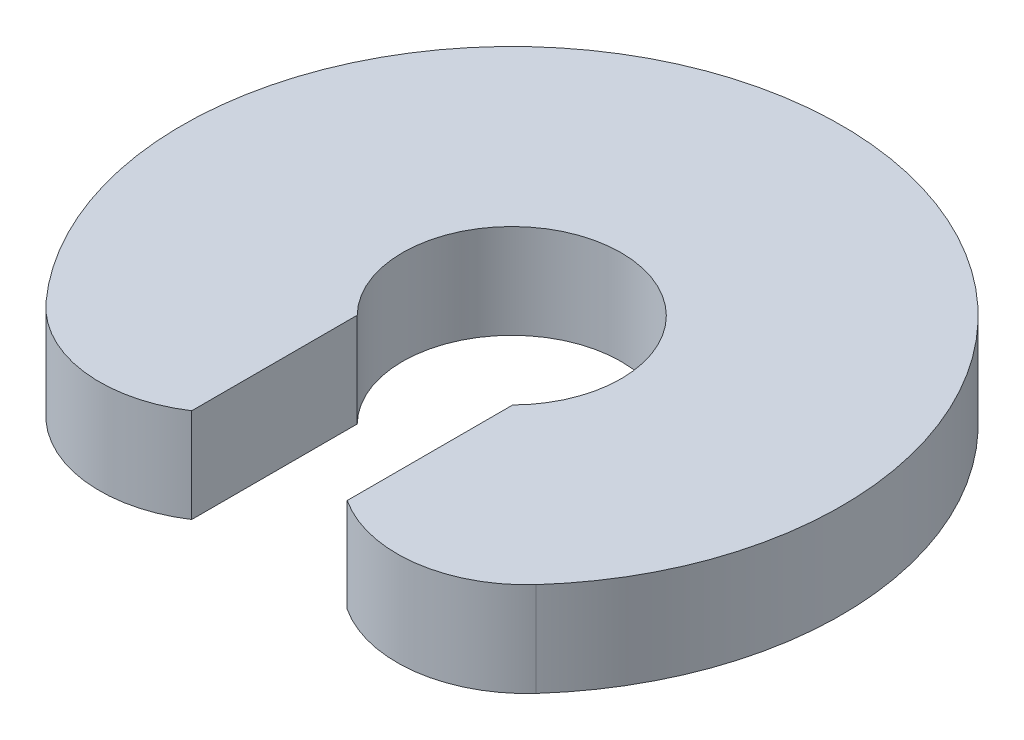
ISO-10303-21;
HEADER;
FILE_DESCRIPTION(('STEP AP214'),'2;1');
FILE_NAME('part.step','',(''),(''),'','','');
FILE_SCHEMA(('AUTOMOTIVE_DESIGN { 1 0 10303 214 1 1 1 1 }'));
ENDSEC;
DATA;
#1=APPLICATION_CONTEXT('core data for automotive mechanical design processes');
#2=APPLICATION_PROTOCOL_DEFINITION('international standard','automotive_design',2000,#1);
#3=PRODUCT_CONTEXT('',#1,'mechanical');
#4=PRODUCT('Part','Part','',(#3));
#5=PRODUCT_RELATED_PRODUCT_CATEGORY('part','',(#4));
#6=PRODUCT_DEFINITION_FORMATION('','',#4);
#7=PRODUCT_DEFINITION_CONTEXT('part definition',#1,'design');
#8=PRODUCT_DEFINITION('design','',#6,#7);
#9=PRODUCT_DEFINITION_SHAPE('','',#8);
#10=(LENGTH_UNIT() NAMED_UNIT(*) SI_UNIT(.MILLI.,.METRE.));
#11=(NAMED_UNIT(*) PLANE_ANGLE_UNIT() SI_UNIT($,.RADIAN.));
#12=(NAMED_UNIT(*) SI_UNIT($,.STERADIAN.) SOLID_ANGLE_UNIT());
#13=UNCERTAINTY_MEASURE_WITH_UNIT(LENGTH_MEASURE(1.E-05),#10,'distance_accuracy_value','');
#14=(GEOMETRIC_REPRESENTATION_CONTEXT(3) GLOBAL_UNCERTAINTY_ASSIGNED_CONTEXT((#13)) GLOBAL_UNIT_ASSIGNED_CONTEXT((#10,
#11,#12)) REPRESENTATION_CONTEXT('',''));
#15=CARTESIAN_POINT('',(0.,0.,0.));
#16=DIRECTION('',(0.,0.,1.));
#17=DIRECTION('',(1.,0.,0.));
#18=AXIS2_PLACEMENT_3D('',#15,#16,#17);
#19=CARTESIAN_POINT('',(315.836550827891,200.,284.380507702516));
#20=DIRECTION('',(0.,-1.,0.));
#21=DIRECTION('',(0.,0.,-1.));
#22=AXIS2_PLACEMENT_3D('',#19,#20,#21);
#23=CYLINDRICAL_SURFACE('',#22,275.);
#24=DIRECTION('',(0.,-1.,0.));
#25=VECTOR('',#24,1.);
#26=CARTESIAN_POINT('',(165.,200.,514.322532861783));
#27=LINE('',#26,#25);
#28=CARTESIAN_POINT('',(165.,200.,514.322532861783));
#29=VERTEX_POINT('',#28);
#30=CARTESIAN_POINT('',(165.,0.,514.322532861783));
#31=VERTEX_POINT('',#30);
#32=EDGE_CURVE('E105',#29,#31,#27,.T.);
#33=ORIENTED_EDGE('',*,*,#32,.T.);
#34=CARTESIAN_POINT('',(315.836550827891,0.,284.380507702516));
#35=DIRECTION('',(0.,1.,0.));
#36=DIRECTION('',(0.,0.,1.));
#37=AXIS2_PLACEMENT_3D('',#34,#35,#36);
#38=CIRCLE('',#37,275.);
#39=CARTESIAN_POINT('',(520.201377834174,0.,468.391424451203));
#40=VERTEX_POINT('',#39);
#41=EDGE_CURVE('E123',#40,#31,#38,.F.);
#42=ORIENTED_EDGE('',*,*,#41,.F.);
#43=DIRECTION('',(0.,-1.,0.));
#44=VECTOR('',#43,1.);
#45=CARTESIAN_POINT('',(520.201377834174,200.,468.391424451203));
#46=LINE('',#45,#44);
#47=CARTESIAN_POINT('',(520.201377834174,200.,468.391424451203));
#48=VERTEX_POINT('',#47);
#49=EDGE_CURVE('E11',#48,#40,#46,.T.);
#50=ORIENTED_EDGE('',*,*,#49,.F.);
#51=CARTESIAN_POINT('',(315.836550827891,200.,284.380507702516));
#52=DIRECTION('',(0.,1.,0.));
#53=DIRECTION('',(0.,0.,1.));
#54=AXIS2_PLACEMENT_3D('',#51,#52,#53);
#55=CIRCLE('',#54,275.);
#56=EDGE_CURVE('E100',#48,#29,#55,.F.);
#57=ORIENTED_EDGE('',*,*,#56,.T.);
#58=EDGE_LOOP('',(#33,#42,#50,#57));
#59=FACE_BOUND('',#58,.T.);
#60=ADVANCED_FACE('F36',(#59),#23,.T.);
#61=CARTESIAN_POINT('',(0.,200.,0.));
#62=DIRECTION('',(0.,-1.,0.));
#63=DIRECTION('',(0.,0.,-1.));
#64=AXIS2_PLACEMENT_3D('',#61,#62,#63);
#65=CYLINDRICAL_SURFACE('',#64,700.);
#66=CARTESIAN_POINT('',(0.,0.,0.));
#67=DIRECTION('',(0.,1.,0.));
#68=DIRECTION('',(0.,0.,1.));
#69=AXIS2_PLACEMENT_3D('',#66,#67,#68);
#70=CIRCLE('',#69,700.);
#71=CARTESIAN_POINT('',(-520.201377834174,0.,468.391424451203));
#72=VERTEX_POINT('',#71);
#73=EDGE_CURVE('E125',#40,#72,#70,.T.);
#74=ORIENTED_EDGE('',*,*,#73,.T.);
#75=DIRECTION('',(0.,-1.,0.));
#76=VECTOR('',#75,1.);
#77=CARTESIAN_POINT('',(-520.201377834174,200.,468.391424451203));
#78=LINE('',#77,#76);
#79=CARTESIAN_POINT('',(-520.201377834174,200.,468.391424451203));
#80=VERTEX_POINT('',#79);
#81=EDGE_CURVE('E43',#80,#72,#78,.T.);
#82=ORIENTED_EDGE('',*,*,#81,.F.);
#83=CARTESIAN_POINT('',(0.,200.,0.));
#84=DIRECTION('',(0.,1.,0.));
#85=DIRECTION('',(0.,0.,1.));
#86=AXIS2_PLACEMENT_3D('',#83,#84,#85);
#87=CIRCLE('',#86,700.);
#88=EDGE_CURVE('E111',#48,#80,#87,.T.);
#89=ORIENTED_EDGE('',*,*,#88,.F.);
#90=ORIENTED_EDGE('',*,*,#49,.T.);
#91=EDGE_LOOP('',(#74,#82,#89,#90));
#92=FACE_BOUND('',#91,.T.);
#93=ADVANCED_FACE('F143',(#92),#65,.T.);
#94=CARTESIAN_POINT('',(-315.836550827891,200.,284.380507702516));
#95=DIRECTION('',(0.,-1.,0.));
#96=DIRECTION('',(0.,0.,-1.));
#97=AXIS2_PLACEMENT_3D('',#94,#95,#96);
#98=CYLINDRICAL_SURFACE('',#97,275.);
#99=CARTESIAN_POINT('',(-315.836550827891,0.,284.380507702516));
#100=DIRECTION('',(0.,1.,0.));
#101=DIRECTION('',(0.,0.,1.));
#102=AXIS2_PLACEMENT_3D('',#99,#100,#101);
#103=CIRCLE('',#102,275.);
#104=CARTESIAN_POINT('',(-165.,0.,514.322532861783));
#105=VERTEX_POINT('',#104);
#106=EDGE_CURVE('E127',#72,#105,#103,.T.);
#107=ORIENTED_EDGE('',*,*,#106,.T.);
#108=DIRECTION('',(0.,-1.,0.));
#109=VECTOR('',#108,1.);
#110=CARTESIAN_POINT('',(-165.,200.,514.322532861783));
#111=LINE('',#110,#109);
#112=CARTESIAN_POINT('',(-165.,200.,514.322532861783));
#113=VERTEX_POINT('',#112);
#114=EDGE_CURVE('E109',#113,#105,#111,.T.);
#115=ORIENTED_EDGE('',*,*,#114,.F.);
#116=CARTESIAN_POINT('',(-315.836550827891,200.,284.380507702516));
#117=DIRECTION('',(0.,1.,0.));
#118=DIRECTION('',(0.,0.,1.));
#119=AXIS2_PLACEMENT_3D('',#116,#117,#118);
#120=CIRCLE('',#119,275.);
#121=EDGE_CURVE('E113',#80,#113,#120,.T.);
#122=ORIENTED_EDGE('',*,*,#121,.F.);
#123=ORIENTED_EDGE('',*,*,#81,.T.);
#124=EDGE_LOOP('',(#107,#115,#122,#123));
#125=FACE_BOUND('',#124,.T.);
#126=ADVANCED_FACE('F138',(#125),#98,.T.);
#127=CARTESIAN_POINT('',(-165.,200.,0.));
#128=DIRECTION('',(1.,0.,0.));
#129=DIRECTION('',(0.,0.,-1.));
#130=AXIS2_PLACEMENT_3D('',#127,#128,#129);
#131=PLANE('',#130);
#132=DIRECTION('',(0.,0.,1.));
#133=VECTOR('',#132,1.);
#134=CARTESIAN_POINT('',(-165.,0.,0.));
#135=LINE('',#134,#133);
#136=CARTESIAN_POINT('',(-165.,0.,163.069193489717));
#137=VERTEX_POINT('',#136);
#138=EDGE_CURVE('E50',#137,#105,#135,.T.);
#139=ORIENTED_EDGE('',*,*,#138,.F.);
#140=DIRECTION('',(0.,-1.,0.));
#141=VECTOR('',#140,1.);
#142=CARTESIAN_POINT('',(-165.,200.,163.069193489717));
#143=LINE('',#142,#141);
#144=CARTESIAN_POINT('',(-165.,200.,163.069193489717));
#145=VERTEX_POINT('',#144);
#146=EDGE_CURVE('E133',#145,#137,#143,.T.);
#147=ORIENTED_EDGE('',*,*,#146,.F.);
#148=DIRECTION('',(0.,0.,1.));
#149=VECTOR('',#148,1.);
#150=CARTESIAN_POINT('',(-165.,200.,0.));
#151=LINE('',#150,#149);
#152=EDGE_CURVE('E120',#145,#113,#151,.T.);
#153=ORIENTED_EDGE('',*,*,#152,.T.);
#154=ORIENTED_EDGE('',*,*,#114,.T.);
#155=EDGE_LOOP('',(#139,#147,#153,#154));
#156=FACE_BOUND('',#155,.T.);
#157=ADVANCED_FACE('F146',(#156),#131,.T.);
#158=CARTESIAN_POINT('',(0.,200.,0.));
#159=DIRECTION('',(0.,-1.,0.));
#160=DIRECTION('',(0.,0.,-1.));
#161=AXIS2_PLACEMENT_3D('',#158,#159,#160);
#162=CYLINDRICAL_SURFACE('',#161,231.983968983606);
#163=CARTESIAN_POINT('',(0.,0.,0.));
#164=DIRECTION('',(0.,1.,0.));
#165=DIRECTION('',(0.,0.,1.));
#166=AXIS2_PLACEMENT_3D('',#163,#164,#165);
#167=CIRCLE('',#166,231.983968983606);
#168=CARTESIAN_POINT('',(165.,0.,163.069193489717));
#169=VERTEX_POINT('',#168);
#170=EDGE_CURVE('E115',#169,#137,#167,.T.);
#171=ORIENTED_EDGE('',*,*,#170,.F.);
#172=DIRECTION('',(0.,-1.,0.));
#173=VECTOR('',#172,1.);
#174=CARTESIAN_POINT('',(165.,200.,163.069193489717));
#175=LINE('',#174,#173);
#176=CARTESIAN_POINT('',(165.,200.,163.069193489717));
#177=VERTEX_POINT('',#176);
#178=EDGE_CURVE('E59',#177,#169,#175,.T.);
#179=ORIENTED_EDGE('',*,*,#178,.F.);
#180=CARTESIAN_POINT('',(0.,200.,0.));
#181=DIRECTION('',(0.,1.,0.));
#182=DIRECTION('',(0.,0.,1.));
#183=AXIS2_PLACEMENT_3D('',#180,#181,#182);
#184=CIRCLE('',#183,231.983968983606);
#185=EDGE_CURVE('E102',#177,#145,#184,.T.);
#186=ORIENTED_EDGE('',*,*,#185,.T.);
#187=ORIENTED_EDGE('',*,*,#146,.T.);
#188=EDGE_LOOP('',(#171,#179,#186,#187));
#189=FACE_BOUND('',#188,.T.);
#190=ADVANCED_FACE('F145',(#189),#162,.F.);
#191=CARTESIAN_POINT('',(165.,200.,0.));
#192=DIRECTION('',(1.,0.,0.));
#193=DIRECTION('',(0.,0.,-1.));
#194=AXIS2_PLACEMENT_3D('',#191,#192,#193);
#195=PLANE('',#194);
#196=DIRECTION('',(0.,0.,1.));
#197=VECTOR('',#196,1.);
#198=CARTESIAN_POINT('',(165.,0.,0.));
#199=LINE('',#198,#197);
#200=EDGE_CURVE('E107',#169,#31,#199,.T.);
#201=ORIENTED_EDGE('',*,*,#200,.T.);
#202=ORIENTED_EDGE('',*,*,#32,.F.);
#203=DIRECTION('',(0.,0.,1.));
#204=VECTOR('',#203,1.);
#205=CARTESIAN_POINT('',(165.,200.,0.));
#206=LINE('',#205,#204);
#207=EDGE_CURVE('E96',#177,#29,#206,.T.);
#208=ORIENTED_EDGE('',*,*,#207,.F.);
#209=ORIENTED_EDGE('',*,*,#178,.T.);
#210=EDGE_LOOP('',(#201,#202,#208,#209));
#211=FACE_BOUND('',#210,.T.);
#212=ADVANCED_FACE('F106',(#211),#195,.F.);
#213=CARTESIAN_POINT('',(0.,200.,0.));
#214=DIRECTION('',(0.,1.,0.));
#215=DIRECTION('',(0.,0.,1.));
#216=AXIS2_PLACEMENT_3D('',#213,#214,#215);
#217=PLANE('',#216);
#218=ORIENTED_EDGE('',*,*,#121,.T.);
#219=ORIENTED_EDGE('',*,*,#152,.F.);
#220=ORIENTED_EDGE('',*,*,#185,.F.);
#221=ORIENTED_EDGE('',*,*,#207,.T.);
#222=ORIENTED_EDGE('',*,*,#56,.F.);
#223=ORIENTED_EDGE('',*,*,#88,.T.);
#224=EDGE_LOOP('',(#218,#219,#220,#221,#222,#223));
#225=FACE_BOUND('',#224,.T.);
#226=ADVANCED_FACE('F99',(#225),#217,.T.);
#227=CARTESIAN_POINT('',(0.,0.,0.));
#228=DIRECTION('',(0.,1.,0.));
#229=DIRECTION('',(0.,0.,1.));
#230=AXIS2_PLACEMENT_3D('',#227,#228,#229);
#231=PLANE('',#230);
#232=ORIENTED_EDGE('',*,*,#138,.T.);
#233=ORIENTED_EDGE('',*,*,#106,.F.);
#234=ORIENTED_EDGE('',*,*,#73,.F.);
#235=ORIENTED_EDGE('',*,*,#41,.T.);
#236=ORIENTED_EDGE('',*,*,#200,.F.);
#237=ORIENTED_EDGE('',*,*,#170,.T.);
#238=EDGE_LOOP('',(#232,#233,#234,#235,#236,#237));
#239=FACE_BOUND('',#238,.T.);
#240=ADVANCED_FACE('F142',(#239),#231,.F.);
#241=CLOSED_SHELL('',(#60,#93,#126,#157,#190,#212,#226,#240));
#242=MANIFOLD_SOLID_BREP('B2',#241);
#243=ADVANCED_BREP_SHAPE_REPRESENTATION('',(#18,#242),#14);
#244=SHAPE_DEFINITION_REPRESENTATION(#9,#243);
ENDSEC;
END-ISO-10303-21;
